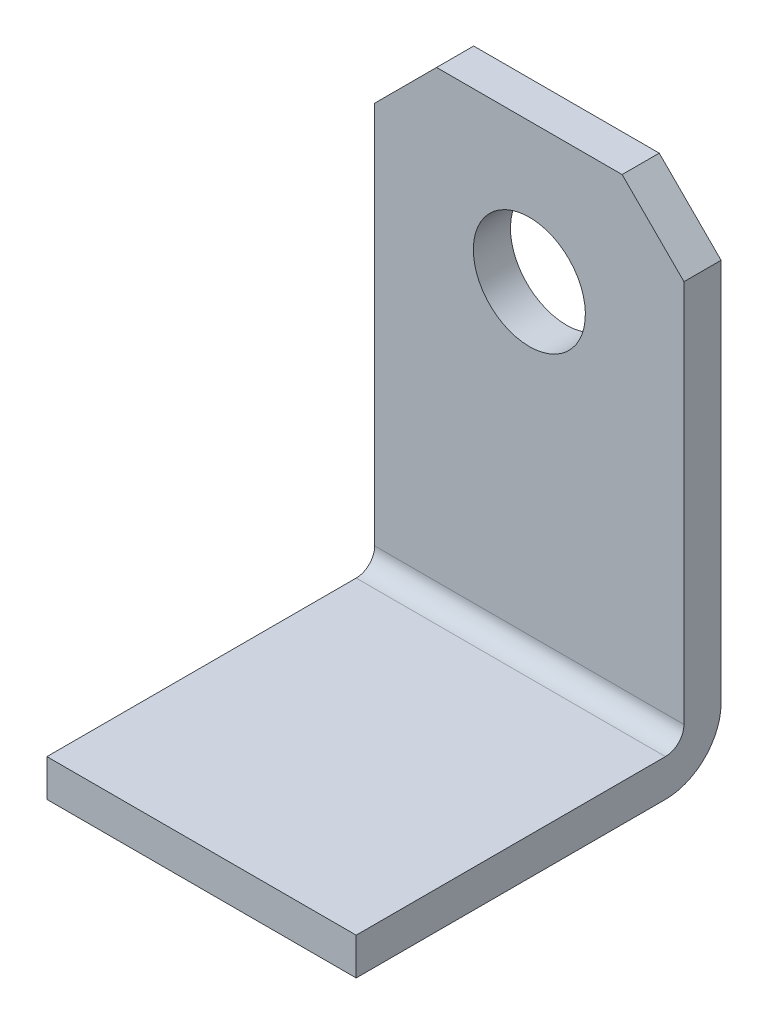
ISO-10303-21;
HEADER;
FILE_DESCRIPTION(('STEP AP214'),'2;1');
FILE_NAME('part.step','',(''),(''),'','','');
FILE_SCHEMA(('AUTOMOTIVE_DESIGN { 1 0 10303 214 1 1 1 1 }'));
ENDSEC;
DATA;
#1=APPLICATION_CONTEXT('core data for automotive mechanical design processes');
#2=APPLICATION_PROTOCOL_DEFINITION('international standard','automotive_design',2000,#1);
#3=PRODUCT_CONTEXT('',#1,'mechanical');
#4=PRODUCT('Part','Part','',(#3));
#5=PRODUCT_RELATED_PRODUCT_CATEGORY('part','',(#4));
#6=PRODUCT_DEFINITION_FORMATION('','',#4);
#7=PRODUCT_DEFINITION_CONTEXT('part definition',#1,'design');
#8=PRODUCT_DEFINITION('design','',#6,#7);
#9=PRODUCT_DEFINITION_SHAPE('','',#8);
#10=(LENGTH_UNIT() NAMED_UNIT(*) SI_UNIT(.MILLI.,.METRE.));
#11=(NAMED_UNIT(*) PLANE_ANGLE_UNIT() SI_UNIT($,.RADIAN.));
#12=(NAMED_UNIT(*) SI_UNIT($,.STERADIAN.) SOLID_ANGLE_UNIT());
#13=UNCERTAINTY_MEASURE_WITH_UNIT(LENGTH_MEASURE(1.E-05),#10,'distance_accuracy_value','');
#14=(GEOMETRIC_REPRESENTATION_CONTEXT(3) GLOBAL_UNCERTAINTY_ASSIGNED_CONTEXT((#13)) GLOBAL_UNIT_ASSIGNED_CONTEXT((#10,
#11,#12)) REPRESENTATION_CONTEXT('',''));
#15=CARTESIAN_POINT('',(0.,0.,0.));
#16=DIRECTION('',(0.,0.,1.));
#17=DIRECTION('',(1.,0.,0.));
#18=AXIS2_PLACEMENT_3D('',#15,#16,#17);
#19=CARTESIAN_POINT('',(0.,0.,2.54));
#20=DIRECTION('',(0.,0.,1.));
#21=DIRECTION('',(1.,0.,0.));
#22=AXIS2_PLACEMENT_3D('',#19,#20,#21);
#23=PLANE('',#22);
#24=DIRECTION('',(1.,0.,0.));
#25=VECTOR('',#24,1.);
#26=CARTESIAN_POINT('',(0.,0.,2.54));
#27=LINE('',#26,#25);
#28=CARTESIAN_POINT('',(-2.54,0.,2.54));
#29=VERTEX_POINT('',#28);
#30=CARTESIAN_POINT('',(2.54,0.,2.54));
#31=VERTEX_POINT('',#30);
#32=EDGE_CURVE('E186',#29,#31,#27,.T.);
#33=ORIENTED_EDGE('',*,*,#32,.T.);
#34=DIRECTION('',(0.,1.,0.));
#35=VECTOR('',#34,1.);
#36=CARTESIAN_POINT('',(2.54,0.,2.54));
#37=LINE('',#36,#35);
#38=CARTESIAN_POINT('',(2.54,0.6096,2.54));
#39=VERTEX_POINT('',#38);
#40=EDGE_CURVE('E102',#31,#39,#37,.T.);
#41=ORIENTED_EDGE('',*,*,#40,.T.);
#42=DIRECTION('',(1.,0.,0.));
#43=VECTOR('',#42,1.);
#44=CARTESIAN_POINT('',(0.,0.6096,2.54));
#45=LINE('',#44,#43);
#46=CARTESIAN_POINT('',(-2.54,0.6096,2.54));
#47=VERTEX_POINT('',#46);
#48=EDGE_CURVE('E109',#47,#39,#45,.T.);
#49=ORIENTED_EDGE('',*,*,#48,.F.);
#50=DIRECTION('',(0.,1.,0.));
#51=VECTOR('',#50,1.);
#52=CARTESIAN_POINT('',(-2.54,0.,2.54));
#53=LINE('',#52,#51);
#54=EDGE_CURVE('E203',#47,#29,#53,.F.);
#55=ORIENTED_EDGE('',*,*,#54,.T.);
#56=EDGE_LOOP('',(#33,#41,#49,#55));
#57=FACE_BOUND('',#56,.T.);
#58=ADVANCED_FACE('F17',(#57),#23,.T.);
#59=CARTESIAN_POINT('',(-2.54,0.9144,-2.54));
#60=DIRECTION('',(1.,0.,0.));
#61=DIRECTION('',(0.,0.,-1.));
#62=AXIS2_PLACEMENT_3D('',#59,#60,#61);
#63=CYLINDRICAL_SURFACE('',#62,0.3048);
#64=DIRECTION('',(1.,0.,0.));
#65=VECTOR('',#64,1.);
#66=CARTESIAN_POINT('',(0.,0.6096,-2.54));
#67=LINE('',#66,#65);
#68=CARTESIAN_POINT('',(2.54,0.6096,-2.54));
#69=VERTEX_POINT('',#68);
#70=CARTESIAN_POINT('',(-2.54,0.6096,-2.54));
#71=VERTEX_POINT('',#70);
#72=EDGE_CURVE('E104',#69,#71,#67,.F.);
#73=ORIENTED_EDGE('',*,*,#72,.F.);
#74=CARTESIAN_POINT('',(2.54,0.9144,-2.54));
#75=DIRECTION('',(1.,0.,0.));
#76=DIRECTION('',(0.,0.,-1.));
#77=AXIS2_PLACEMENT_3D('',#74,#75,#76);
#78=CIRCLE('',#77,0.3048);
#79=CARTESIAN_POINT('',(2.54,0.914400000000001,-2.84479999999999));
#80=VERTEX_POINT('',#79);
#81=EDGE_CURVE('E20',#80,#69,#78,.F.);
#82=ORIENTED_EDGE('',*,*,#81,.F.);
#83=DIRECTION('',(1.,0.,0.));
#84=VECTOR('',#83,1.);
#85=CARTESIAN_POINT('',(0.,0.914400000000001,-2.8448));
#86=LINE('',#85,#84);
#87=CARTESIAN_POINT('',(-2.54,0.914400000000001,-2.8448));
#88=VERTEX_POINT('',#87);
#89=EDGE_CURVE('E195',#88,#80,#86,.T.);
#90=ORIENTED_EDGE('',*,*,#89,.F.);
#91=CARTESIAN_POINT('',(-2.54,0.9144,-2.54));
#92=DIRECTION('',(1.,0.,0.));
#93=DIRECTION('',(0.,0.,-1.));
#94=AXIS2_PLACEMENT_3D('',#91,#92,#93);
#95=CIRCLE('',#94,0.3048);
#96=EDGE_CURVE('E101',#71,#88,#95,.T.);
#97=ORIENTED_EDGE('',*,*,#96,.F.);
#98=EDGE_LOOP('',(#73,#82,#90,#97));
#99=FACE_BOUND('',#98,.T.);
#100=ADVANCED_FACE('F105',(#99),#63,.F.);
#101=CARTESIAN_POINT('',(0.,0.6096,0.));
#102=DIRECTION('',(0.,1.,0.));
#103=DIRECTION('',(0.,0.,1.));
#104=AXIS2_PLACEMENT_3D('',#101,#102,#103);
#105=PLANE('',#104);
#106=ORIENTED_EDGE('',*,*,#48,.T.);
#107=DIRECTION('',(0.,0.,-1.));
#108=VECTOR('',#107,1.);
#109=CARTESIAN_POINT('',(2.54,0.6096,0.));
#110=LINE('',#109,#108);
#111=EDGE_CURVE('E97',#69,#39,#110,.F.);
#112=ORIENTED_EDGE('',*,*,#111,.F.);
#113=ORIENTED_EDGE('',*,*,#72,.T.);
#114=DIRECTION('',(0.,0.,1.));
#115=VECTOR('',#114,1.);
#116=CARTESIAN_POINT('',(-2.54,0.6096,0.));
#117=LINE('',#116,#115);
#118=EDGE_CURVE('E156',#47,#71,#117,.F.);
#119=ORIENTED_EDGE('',*,*,#118,.F.);
#120=EDGE_LOOP('',(#106,#112,#113,#119));
#121=FACE_BOUND('',#120,.T.);
#122=ADVANCED_FACE('F112',(#121),#105,.T.);
#123=CARTESIAN_POINT('',(0.,0.,0.));
#124=DIRECTION('',(0.,1.,0.));
#125=DIRECTION('',(0.,0.,1.));
#126=AXIS2_PLACEMENT_3D('',#123,#124,#125);
#127=PLANE('',#126);
#128=DIRECTION('',(1.,0.,0.));
#129=VECTOR('',#128,1.);
#130=CARTESIAN_POINT('',(-2.54,0.,-2.53999999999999));
#131=LINE('',#130,#129);
#132=CARTESIAN_POINT('',(2.54,0.,-2.54));
#133=VERTEX_POINT('',#132);
#134=CARTESIAN_POINT('',(-2.54,0.,-2.53999999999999));
#135=VERTEX_POINT('',#134);
#136=EDGE_CURVE('E155',#133,#135,#131,.F.);
#137=ORIENTED_EDGE('',*,*,#136,.F.);
#138=DIRECTION('',(0.,0.,-1.));
#139=VECTOR('',#138,1.);
#140=CARTESIAN_POINT('',(2.54,0.,0.));
#141=LINE('',#140,#139);
#142=EDGE_CURVE('E114',#31,#133,#141,.T.);
#143=ORIENTED_EDGE('',*,*,#142,.F.);
#144=ORIENTED_EDGE('',*,*,#32,.F.);
#145=DIRECTION('',(0.,0.,1.));
#146=VECTOR('',#145,1.);
#147=CARTESIAN_POINT('',(-2.54,0.,0.));
#148=LINE('',#147,#146);
#149=EDGE_CURVE('E160',#135,#29,#148,.T.);
#150=ORIENTED_EDGE('',*,*,#149,.F.);
#151=EDGE_LOOP('',(#137,#143,#144,#150));
#152=FACE_BOUND('',#151,.T.);
#153=ADVANCED_FACE('F242',(#152),#127,.F.);
#154=CARTESIAN_POINT('',(0.,4.37330683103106,-2.84479999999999));
#155=DIRECTION('',(0.,0.,1.));
#156=DIRECTION('',(0.,-1.,0.));
#157=AXIS2_PLACEMENT_3D('',#154,#155,#156);
#158=PLANE('',#157);
#159=DIRECTION('',(-0.707106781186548,0.707106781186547,0.));
#160=VECTOR('',#159,1.);
#161=CARTESIAN_POINT('',(2.032,7.7216,-2.84479999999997));
#162=LINE('',#161,#160);
#163=CARTESIAN_POINT('',(1.524,8.2296,-2.84479999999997));
#164=VERTEX_POINT('',#163);
#165=CARTESIAN_POINT('',(2.54,7.2136,-2.84479999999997));
#166=VERTEX_POINT('',#165);
#167=EDGE_CURVE('E144',#164,#166,#162,.F.);
#168=ORIENTED_EDGE('',*,*,#167,.F.);
#169=DIRECTION('',(1.,0.,0.));
#170=VECTOR('',#169,1.);
#171=CARTESIAN_POINT('',(0.,8.2296,-2.84479999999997));
#172=LINE('',#171,#170);
#173=CARTESIAN_POINT('',(-1.524,8.2296,-2.84479999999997));
#174=VERTEX_POINT('',#173);
#175=EDGE_CURVE('E143',#174,#164,#172,.T.);
#176=ORIENTED_EDGE('',*,*,#175,.F.);
#177=DIRECTION('',(-0.707106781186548,-0.707106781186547,0.));
#178=VECTOR('',#177,1.);
#179=CARTESIAN_POINT('',(-1.524,8.2296,-2.84479999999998));
#180=LINE('',#179,#178);
#181=CARTESIAN_POINT('',(-2.54,7.2136,-2.84479999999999));
#182=VERTEX_POINT('',#181);
#183=EDGE_CURVE('E189',#174,#182,#180,.T.);
#184=ORIENTED_EDGE('',*,*,#183,.T.);
#185=DIRECTION('',(0.,1.,0.));
#186=VECTOR('',#185,1.);
#187=CARTESIAN_POINT('',(-2.54,0.,-2.8448));
#188=LINE('',#187,#186);
#189=EDGE_CURVE('E152',#88,#182,#188,.T.);
#190=ORIENTED_EDGE('',*,*,#189,.F.);
#191=ORIENTED_EDGE('',*,*,#89,.T.);
#192=DIRECTION('',(0.,1.,0.));
#193=VECTOR('',#192,1.);
#194=CARTESIAN_POINT('',(2.54,0.,-2.84479999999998));
#195=LINE('',#194,#193);
#196=EDGE_CURVE('E100',#166,#80,#195,.F.);
#197=ORIENTED_EDGE('',*,*,#196,.F.);
#198=EDGE_LOOP('',(#168,#176,#184,#190,#191,#197));
#199=FACE_BOUND('',#198,.T.);
#200=CARTESIAN_POINT('',(0.,5.94082057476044,-2.84479999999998));
#201=DIRECTION('',(0.,0.,1.));
#202=DIRECTION('',(0.,-1.,0.));
#203=AXIS2_PLACEMENT_3D('',#200,#201,#202);
#204=CIRCLE('',#203,0.920148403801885);
#205=CARTESIAN_POINT('',(0.,5.02067217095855,-2.84479999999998));
#206=VERTEX_POINT('',#205);
#207=EDGE_CURVE('E165',#206,#206,#204,.F.);
#208=ORIENTED_EDGE('',*,*,#207,.T.);
#209=EDGE_LOOP('',(#208));
#210=FACE_BOUND('',#209,.T.);
#211=ADVANCED_FACE('F221',(#199,#210),#158,.T.);
#212=CARTESIAN_POINT('',(0.,5.94082057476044,-3.45439999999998));
#213=DIRECTION('',(0.,0.,1.));
#214=DIRECTION('',(0.,-1.,0.));
#215=AXIS2_PLACEMENT_3D('',#212,#213,#214);
#216=CYLINDRICAL_SURFACE('',#215,0.920148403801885);
#217=CARTESIAN_POINT('',(0.,5.94082057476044,-3.45439999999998));
#218=DIRECTION('',(0.,0.,1.));
#219=DIRECTION('',(0.,-1.,0.));
#220=AXIS2_PLACEMENT_3D('',#217,#218,#219);
#221=CIRCLE('',#220,0.920148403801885);
#222=CARTESIAN_POINT('',(0.,5.02067217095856,-3.45439999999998));
#223=VERTEX_POINT('',#222);
#224=EDGE_CURVE('E149',#223,#223,#221,.F.);
#225=ORIENTED_EDGE('',*,*,#224,.T.);
#226=EDGE_LOOP('',(#225));
#227=FACE_BOUND('',#226,.T.);
#228=ORIENTED_EDGE('',*,*,#207,.F.);
#229=EDGE_LOOP('',(#228));
#230=FACE_BOUND('',#229,.T.);
#231=ADVANCED_FACE('F307',(#227,#230),#216,.F.);
#232=CARTESIAN_POINT('',(-2.54,0.,0.));
#233=DIRECTION('',(-1.,0.,0.));
#234=DIRECTION('',(0.,0.,1.));
#235=AXIS2_PLACEMENT_3D('',#232,#233,#234);
#236=PLANE('',#235);
#237=ORIENTED_EDGE('',*,*,#96,.T.);
#238=ORIENTED_EDGE('',*,*,#189,.T.);
#239=DIRECTION('',(0.,0.,1.));
#240=VECTOR('',#239,1.);
#241=CARTESIAN_POINT('',(-2.54,7.2136,-1.42239999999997));
#242=LINE('',#241,#240);
#243=CARTESIAN_POINT('',(-2.54,7.2136,-3.45439999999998));
#244=VERTEX_POINT('',#243);
#245=EDGE_CURVE('E168',#244,#182,#242,.T.);
#246=ORIENTED_EDGE('',*,*,#245,.F.);
#247=DIRECTION('',(0.,-1.,0.));
#248=VECTOR('',#247,1.);
#249=CARTESIAN_POINT('',(-2.54,4.37330683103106,-3.45439999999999));
#250=LINE('',#249,#248);
#251=CARTESIAN_POINT('',(-2.54,0.914400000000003,-3.4544));
#252=VERTEX_POINT('',#251);
#253=EDGE_CURVE('E131',#244,#252,#250,.T.);
#254=ORIENTED_EDGE('',*,*,#253,.T.);
#255=CARTESIAN_POINT('',(-2.54,0.9144,-2.53999999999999));
#256=DIRECTION('',(1.,0.,0.));
#257=DIRECTION('',(0.,0.,-1.));
#258=AXIS2_PLACEMENT_3D('',#255,#256,#257);
#259=CIRCLE('',#258,0.914400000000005);
#260=EDGE_CURVE('E118',#135,#252,#259,.T.);
#261=ORIENTED_EDGE('',*,*,#260,.F.);
#262=ORIENTED_EDGE('',*,*,#149,.T.);
#263=ORIENTED_EDGE('',*,*,#54,.F.);
#264=ORIENTED_EDGE('',*,*,#118,.T.);
#265=EDGE_LOOP('',(#237,#238,#246,#254,#261,#262,#263,#264));
#266=FACE_BOUND('',#265,.T.);
#267=ADVANCED_FACE('F216',(#266),#236,.T.);
#268=CARTESIAN_POINT('',(-2.54,0.9144,-2.53999999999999));
#269=DIRECTION('',(1.,0.,0.));
#270=DIRECTION('',(0.,0.,-1.));
#271=AXIS2_PLACEMENT_3D('',#268,#269,#270);
#272=CYLINDRICAL_SURFACE('',#271,0.914400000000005);
#273=DIRECTION('',(1.,0.,0.));
#274=VECTOR('',#273,1.);
#275=CARTESIAN_POINT('',(0.,0.914400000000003,-3.4544));
#276=LINE('',#275,#274);
#277=CARTESIAN_POINT('',(2.54,0.914400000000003,-3.4544));
#278=VERTEX_POINT('',#277);
#279=EDGE_CURVE('E127',#252,#278,#276,.T.);
#280=ORIENTED_EDGE('',*,*,#279,.T.);
#281=CARTESIAN_POINT('',(2.54,0.9144,-2.54));
#282=DIRECTION('',(1.,0.,0.));
#283=DIRECTION('',(0.,0.,-1.));
#284=AXIS2_PLACEMENT_3D('',#281,#282,#283);
#285=CIRCLE('',#284,0.914400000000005);
#286=EDGE_CURVE('E116',#133,#278,#285,.T.);
#287=ORIENTED_EDGE('',*,*,#286,.F.);
#288=ORIENTED_EDGE('',*,*,#136,.T.);
#289=ORIENTED_EDGE('',*,*,#260,.T.);
#290=EDGE_LOOP('',(#280,#287,#288,#289));
#291=FACE_BOUND('',#290,.T.);
#292=ADVANCED_FACE('F236',(#291),#272,.T.);
#293=CARTESIAN_POINT('',(2.54,0.,0.));
#294=DIRECTION('',(1.,0.,0.));
#295=DIRECTION('',(0.,0.,-1.));
#296=AXIS2_PLACEMENT_3D('',#293,#294,#295);
#297=PLANE('',#296);
#298=ORIENTED_EDGE('',*,*,#286,.T.);
#299=DIRECTION('',(0.,-1.,0.));
#300=VECTOR('',#299,1.);
#301=CARTESIAN_POINT('',(2.54,4.37330683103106,-3.45439999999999));
#302=LINE('',#301,#300);
#303=CARTESIAN_POINT('',(2.54,7.2136,-3.45439999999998));
#304=VERTEX_POINT('',#303);
#305=EDGE_CURVE('E130',#278,#304,#302,.F.);
#306=ORIENTED_EDGE('',*,*,#305,.T.);
#307=DIRECTION('',(0.,0.,1.));
#308=VECTOR('',#307,1.);
#309=CARTESIAN_POINT('',(2.54,7.2136,-1.42239999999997));
#310=LINE('',#309,#308);
#311=EDGE_CURVE('E141',#166,#304,#310,.F.);
#312=ORIENTED_EDGE('',*,*,#311,.F.);
#313=ORIENTED_EDGE('',*,*,#196,.T.);
#314=ORIENTED_EDGE('',*,*,#81,.T.);
#315=ORIENTED_EDGE('',*,*,#111,.T.);
#316=ORIENTED_EDGE('',*,*,#40,.F.);
#317=ORIENTED_EDGE('',*,*,#142,.T.);
#318=EDGE_LOOP('',(#298,#306,#312,#313,#314,#315,#316,#317));
#319=FACE_BOUND('',#318,.T.);
#320=ADVANCED_FACE('F95',(#319),#297,.T.);
#321=CARTESIAN_POINT('',(2.032,7.7216,-1.42239999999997));
#322=DIRECTION('',(0.707106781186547,0.707106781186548,0.));
#323=DIRECTION('',(-0.707106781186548,0.707106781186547,0.));
#324=AXIS2_PLACEMENT_3D('',#321,#322,#323);
#325=PLANE('',#324);
#326=ORIENTED_EDGE('',*,*,#167,.T.);
#327=ORIENTED_EDGE('',*,*,#311,.T.);
#328=DIRECTION('',(-0.707106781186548,0.707106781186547,0.));
#329=VECTOR('',#328,1.);
#330=CARTESIAN_POINT('',(2.54,7.2136,-3.45439999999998));
#331=LINE('',#330,#329);
#332=CARTESIAN_POINT('',(1.524,8.2296,-3.45439999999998));
#333=VERTEX_POINT('',#332);
#334=EDGE_CURVE('E134',#304,#333,#331,.T.);
#335=ORIENTED_EDGE('',*,*,#334,.T.);
#336=DIRECTION('',(0.,0.,1.));
#337=VECTOR('',#336,1.);
#338=CARTESIAN_POINT('',(1.524,8.2296,-2.84479999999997));
#339=LINE('',#338,#337);
#340=EDGE_CURVE('E171',#164,#333,#339,.F.);
#341=ORIENTED_EDGE('',*,*,#340,.F.);
#342=EDGE_LOOP('',(#326,#327,#335,#341));
#343=FACE_BOUND('',#342,.T.);
#344=ADVANCED_FACE('F245',(#343),#325,.T.);
#345=CARTESIAN_POINT('',(0.,8.2296,-2.84479999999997));
#346=DIRECTION('',(0.,1.,0.));
#347=DIRECTION('',(0.,0.,1.));
#348=AXIS2_PLACEMENT_3D('',#345,#346,#347);
#349=PLANE('',#348);
#350=ORIENTED_EDGE('',*,*,#340,.T.);
#351=DIRECTION('',(1.,0.,0.));
#352=VECTOR('',#351,1.);
#353=CARTESIAN_POINT('',(0.,8.2296,-3.45439999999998));
#354=LINE('',#353,#352);
#355=CARTESIAN_POINT('',(-1.524,8.2296,-3.45439999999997));
#356=VERTEX_POINT('',#355);
#357=EDGE_CURVE('E26',#333,#356,#354,.F.);
#358=ORIENTED_EDGE('',*,*,#357,.T.);
#359=DIRECTION('',(0.,0.,1.));
#360=VECTOR('',#359,1.);
#361=CARTESIAN_POINT('',(-1.524,8.2296,-1.42239999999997));
#362=LINE('',#361,#360);
#363=EDGE_CURVE('E34',#174,#356,#362,.F.);
#364=ORIENTED_EDGE('',*,*,#363,.F.);
#365=ORIENTED_EDGE('',*,*,#175,.T.);
#366=EDGE_LOOP('',(#350,#358,#364,#365));
#367=FACE_BOUND('',#366,.T.);
#368=ADVANCED_FACE('F249',(#367),#349,.T.);
#369=CARTESIAN_POINT('',(-2.032,7.7216,-1.42239999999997));
#370=DIRECTION('',(-0.707106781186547,0.707106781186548,0.));
#371=DIRECTION('',(-0.707106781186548,-0.707106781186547,0.));
#372=AXIS2_PLACEMENT_3D('',#369,#370,#371);
#373=PLANE('',#372);
#374=ORIENTED_EDGE('',*,*,#183,.F.);
#375=ORIENTED_EDGE('',*,*,#363,.T.);
#376=DIRECTION('',(-0.707106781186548,-0.707106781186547,0.));
#377=VECTOR('',#376,1.);
#378=CARTESIAN_POINT('',(-1.524,8.2296,-3.45439999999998));
#379=LINE('',#378,#377);
#380=EDGE_CURVE('E11',#356,#244,#379,.T.);
#381=ORIENTED_EDGE('',*,*,#380,.T.);
#382=ORIENTED_EDGE('',*,*,#245,.T.);
#383=EDGE_LOOP('',(#374,#375,#381,#382));
#384=FACE_BOUND('',#383,.T.);
#385=ADVANCED_FACE('F224',(#384),#373,.T.);
#386=CARTESIAN_POINT('',(0.,4.37330683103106,-3.45439999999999));
#387=DIRECTION('',(0.,0.,1.));
#388=DIRECTION('',(0.,-1.,0.));
#389=AXIS2_PLACEMENT_3D('',#386,#387,#388);
#390=PLANE('',#389);
#391=ORIENTED_EDGE('',*,*,#357,.F.);
#392=ORIENTED_EDGE('',*,*,#334,.F.);
#393=ORIENTED_EDGE('',*,*,#305,.F.);
#394=ORIENTED_EDGE('',*,*,#279,.F.);
#395=ORIENTED_EDGE('',*,*,#253,.F.);
#396=ORIENTED_EDGE('',*,*,#380,.F.);
#397=EDGE_LOOP('',(#391,#392,#393,#394,#395,#396));
#398=FACE_BOUND('',#397,.T.);
#399=ORIENTED_EDGE('',*,*,#224,.F.);
#400=EDGE_LOOP('',(#399));
#401=FACE_BOUND('',#400,.T.);
#402=ADVANCED_FACE('F229',(#398,#401),#390,.F.);
#403=CLOSED_SHELL('',(#58,#100,#122,#153,#211,#231,#267,#292,#320,#344,#368,#385,#402));
#404=MANIFOLD_SOLID_BREP('B1',#403);
#405=ADVANCED_BREP_SHAPE_REPRESENTATION('',(#18,#404),#14);
#406=SHAPE_DEFINITION_REPRESENTATION(#9,#405);
ENDSEC;
END-ISO-10303-21;
